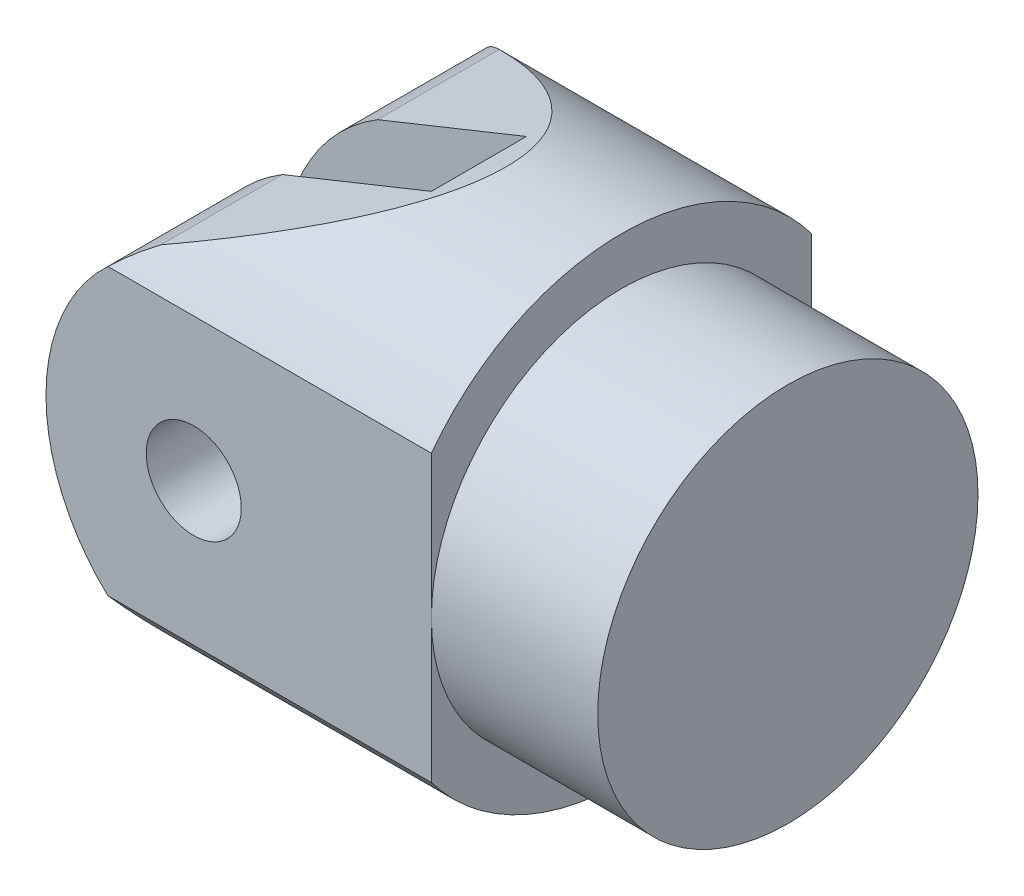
from build123d import *

# Parameters (mm, degrees)
SKETCH_1_R               = 50
EXTRUDE_1_DEPTH          = 100
SKETCH_1_3_R             = 40
EXTRUDE_2_DEPTH          = 35
CUT_EXTRUDE_5_DEPTH      = 123.474487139
CUT_EXTRUDE_5_DEPTH_BACK = 123.474487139
CUT_EXTRUDE_1_DEPTH      = 50
SKETCH_3_W               = 19.615049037
SKETCH_3_H               = 60
SKETCH_3_W_2             = 19.748202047
CUT_EXTRUDE_2_DEPTH      = 108.58281708
SKETCH_4_W               = 60
SKETCH_4_H               = 108.256329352
CUT_EXTRUDE_3_DEPTH      = 10
SKETCH_5_R               = 10
CUT_EXTRUDE_4_DEPTH      = 125.394785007


with BuildPart() as part:
    # Sketch 1 → Extrude 1 (new body)
    with BuildSketch(Plane(origin=(0, 0, 0), x_dir=(0, 0, -1), z_dir=(1, 0, 0))):
        Circle(SKETCH_1_R)
    extrude(amount=-EXTRUDE_1_DEPTH)

    # Sketch 1_3 → Extrude 2 (add)
    with BuildSketch(Plane(origin=(0, 0, 0), x_dir=(0, 0, -1), z_dir=(1, 0, 0))):
        Circle(SKETCH_1_3_R)
    extrude(amount=EXTRUDE_2_DEPTH)

    # Sketch 6 → Cut-Extrude 5 (cut, two sides: drawn at the far end of the back side and taken through both)
    with BuildSketch(Plane.XY.offset(-CUT_EXTRUDE_5_DEPTH_BACK)):
        Polygon((-148.592394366, 0), (-24.312374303, 50), (-177.944056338, 92.216788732), (-177.944056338, -104.045070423), (-24.312374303, -104.045070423), (-24.312374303, -50.000356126), align=None)
    extrude(amount=CUT_EXTRUDE_5_DEPTH + CUT_EXTRUDE_5_DEPTH_BACK, mode=Mode.SUBTRACT)

    # Sketch 2 → Cut-Extrude 1 (cut, symmetric)
    with BuildSketch(Plane.XY):
        with BuildLine():
            Line((-49.77879656, 39.899752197), (-121.603145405, 57.142514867))
            Line((-121.603145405, 57.142514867), (-100, -50))
            Line((-100, -50), (-51.498316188, -39.438608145))
            ThreePointArc((-51.498316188, -39.438608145), (-81.070947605, 0.890140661), (-49.77879656, 39.899752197))
        make_face()
    extrude(amount=CUT_EXTRUDE_1_DEPTH, both=True, mode=Mode.SUBTRACT)

    # Sketch 3 → Cut-Extrude 2 (cut, through all)
    with BuildSketch(Plane(origin=(0, 0, 0), x_dir=(0, 0, -1), z_dir=(1, 0, 0))):
        with Locations((-49.807524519, 0)):
            Rectangle(SKETCH_3_W, SKETCH_3_H)
        with Locations((49.874101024, 0)):
            Rectangle(SKETCH_3_W_2, SKETCH_3_H)
    extrude(amount=-CUT_EXTRUDE_2_DEPTH, mode=Mode.SUBTRACT)

    # Sketch 4 → Cut-Extrude 3 (cut, symmetric)
    with BuildSketch(Plane.XY):
        with Locations((-60, -1.23957629)):
            Rectangle(SKETCH_4_W, SKETCH_4_H)
    extrude(amount=CUT_EXTRUDE_3_DEPTH, both=True, mode=Mode.SUBTRACT)

    # Sketch 5 → Cut-Extrude 4 (cut, through all)
    with BuildSketch(Plane.XY.offset(40)):
        with Locations((-50, 0)):
            Circle(SKETCH_5_R)
    extrude(amount=-CUT_EXTRUDE_4_DEPTH, mode=Mode.SUBTRACT)


solid = part.part
